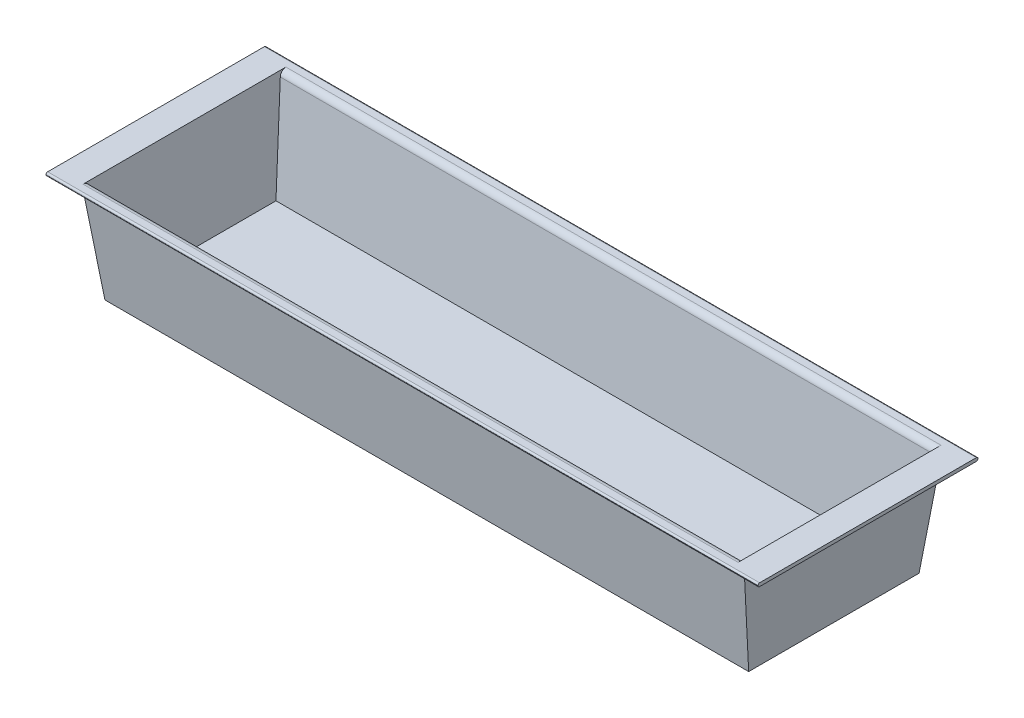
ISO-10303-21;
HEADER;
FILE_DESCRIPTION(('STEP AP214'),'2;1');
FILE_NAME('part.step','',(''),(''),'','','');
FILE_SCHEMA(('AUTOMOTIVE_DESIGN { 1 0 10303 214 1 1 1 1 }'));
ENDSEC;
DATA;
#1=APPLICATION_CONTEXT('core data for automotive mechanical design processes');
#2=APPLICATION_PROTOCOL_DEFINITION('international standard','automotive_design',2000,#1);
#3=PRODUCT_CONTEXT('',#1,'mechanical');
#4=PRODUCT('Part','Part','',(#3));
#5=PRODUCT_RELATED_PRODUCT_CATEGORY('part','',(#4));
#6=PRODUCT_DEFINITION_FORMATION('','',#4);
#7=PRODUCT_DEFINITION_CONTEXT('part definition',#1,'design');
#8=PRODUCT_DEFINITION('design','',#6,#7);
#9=PRODUCT_DEFINITION_SHAPE('','',#8);
#10=(LENGTH_UNIT() NAMED_UNIT(*) SI_UNIT(.MILLI.,.METRE.));
#11=(NAMED_UNIT(*) PLANE_ANGLE_UNIT() SI_UNIT($,.RADIAN.));
#12=(NAMED_UNIT(*) SI_UNIT($,.STERADIAN.) SOLID_ANGLE_UNIT());
#13=UNCERTAINTY_MEASURE_WITH_UNIT(LENGTH_MEASURE(1.E-05),#10,'distance_accuracy_value','');
#14=(GEOMETRIC_REPRESENTATION_CONTEXT(3) GLOBAL_UNCERTAINTY_ASSIGNED_CONTEXT((#13)) GLOBAL_UNIT_ASSIGNED_CONTEXT((#10,
#11,#12)) REPRESENTATION_CONTEXT('',''));
#15=CARTESIAN_POINT('',(0.,0.,0.));
#16=DIRECTION('',(0.,0.,1.));
#17=DIRECTION('',(1.,0.,0.));
#18=AXIS2_PLACEMENT_3D('',#15,#16,#17);
#19=CARTESIAN_POINT('',(0.,0.,0.));
#20=DIRECTION('',(0.,-1.,0.));
#21=DIRECTION('',(0.,0.,-1.));
#22=AXIS2_PLACEMENT_3D('',#19,#20,#21);
#23=PLANE('',#22);
#24=DIRECTION('',(0.,0.,1.));
#25=VECTOR('',#24,1.);
#26=CARTESIAN_POINT('',(-172.991972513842,0.,0.));
#27=LINE('',#26,#25);
#28=CARTESIAN_POINT('',(-172.991972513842,0.,-53.5762929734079));
#29=VERTEX_POINT('',#28);
#30=CARTESIAN_POINT('',(-172.991972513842,0.,53.5762929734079));
#31=VERTEX_POINT('',#30);
#32=EDGE_CURVE('E204',#29,#31,#27,.T.);
#33=ORIENTED_EDGE('',*,*,#32,.F.);
#34=DIRECTION('',(-1.,0.,0.));
#35=VECTOR('',#34,1.);
#36=CARTESIAN_POINT('',(172.991972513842,0.,-53.5762929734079));
#37=LINE('',#36,#35);
#38=CARTESIAN_POINT('',(172.991972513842,0.,-53.5762929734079));
#39=VERTEX_POINT('',#38);
#40=EDGE_CURVE('E272',#29,#39,#37,.F.);
#41=ORIENTED_EDGE('',*,*,#40,.T.);
#42=DIRECTION('',(0.,0.,-1.));
#43=VECTOR('',#42,1.);
#44=CARTESIAN_POINT('',(172.991972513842,0.,0.));
#45=LINE('',#44,#43);
#46=CARTESIAN_POINT('',(172.991972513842,0.,53.5762929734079));
#47=VERTEX_POINT('',#46);
#48=EDGE_CURVE('E201',#47,#39,#45,.T.);
#49=ORIENTED_EDGE('',*,*,#48,.F.);
#50=DIRECTION('',(1.,0.,0.));
#51=VECTOR('',#50,1.);
#52=CARTESIAN_POINT('',(-172.991972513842,0.,53.5762929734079));
#53=LINE('',#52,#51);
#54=EDGE_CURVE('E282',#47,#31,#53,.F.);
#55=ORIENTED_EDGE('',*,*,#54,.T.);
#56=EDGE_LOOP('',(#33,#41,#49,#55));
#57=FACE_BOUND('',#56,.T.);
#58=DIRECTION('',(0.,0.,1.));
#59=VECTOR('',#58,1.);
#60=CARTESIAN_POINT('',(-188.,0.,58.125));
#61=LINE('',#60,#59);
#62=CARTESIAN_POINT('',(-188.,0.,-57.25));
#63=VERTEX_POINT('',#62);
#64=CARTESIAN_POINT('',(-188.,0.,57.25));
#65=VERTEX_POINT('',#64);
#66=EDGE_CURVE('E441',#63,#65,#61,.T.);
#67=ORIENTED_EDGE('',*,*,#66,.T.);
#68=DIRECTION('',(1.,0.,0.));
#69=VECTOR('',#68,1.);
#70=CARTESIAN_POINT('',(188.,0.,57.25));
#71=LINE('',#70,#69);
#72=CARTESIAN_POINT('',(188.,0.,57.25));
#73=VERTEX_POINT('',#72);
#74=EDGE_CURVE('E308',#65,#73,#71,.T.);
#75=ORIENTED_EDGE('',*,*,#74,.T.);
#76=DIRECTION('',(0.,0.,-1.));
#77=VECTOR('',#76,1.);
#78=CARTESIAN_POINT('',(188.,0.,58.125));
#79=LINE('',#78,#77);
#80=CARTESIAN_POINT('',(188.,0.,-57.25));
#81=VERTEX_POINT('',#80);
#82=EDGE_CURVE('E315',#73,#81,#79,.T.);
#83=ORIENTED_EDGE('',*,*,#82,.T.);
#84=DIRECTION('',(-1.,0.,0.));
#85=VECTOR('',#84,1.);
#86=CARTESIAN_POINT('',(-188.,0.,-57.25));
#87=LINE('',#86,#85);
#88=EDGE_CURVE('E317',#81,#63,#87,.T.);
#89=ORIENTED_EDGE('',*,*,#88,.T.);
#90=EDGE_LOOP('',(#67,#75,#83,#89));
#91=FACE_BOUND('',#90,.T.);
#92=ADVANCED_FACE('F42',(#57,#91),#23,.F.);
#93=CARTESIAN_POINT('',(0.,-53.75,0.));
#94=DIRECTION('',(0.,1.,0.));
#95=DIRECTION('',(0.,0.,1.));
#96=AXIS2_PLACEMENT_3D('',#93,#94,#95);
#97=PLANE('',#96);
#98=DIRECTION('',(0.,0.,-1.));
#99=VECTOR('',#98,1.);
#100=CARTESIAN_POINT('',(168.171344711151,-53.75,0.));
#101=LINE('',#100,#99);
#102=CARTESIAN_POINT('',(168.171344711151,-53.75,43.5032934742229));
#103=VERTEX_POINT('',#102);
#104=CARTESIAN_POINT('',(168.171344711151,-53.75,-43.5032934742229));
#105=VERTEX_POINT('',#104);
#106=EDGE_CURVE('E172',#103,#105,#101,.T.);
#107=ORIENTED_EDGE('',*,*,#106,.T.);
#108=DIRECTION('',(-1.,0.,0.));
#109=VECTOR('',#108,1.);
#110=CARTESIAN_POINT('',(0.,-53.75,-43.5032934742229));
#111=LINE('',#110,#109);
#112=CARTESIAN_POINT('',(-168.171344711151,-53.75,-43.5032934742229));
#113=VERTEX_POINT('',#112);
#114=EDGE_CURVE('E184',#105,#113,#111,.T.);
#115=ORIENTED_EDGE('',*,*,#114,.T.);
#116=DIRECTION('',(0.,0.,1.));
#117=VECTOR('',#116,1.);
#118=CARTESIAN_POINT('',(-168.171344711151,-53.75,0.));
#119=LINE('',#118,#117);
#120=CARTESIAN_POINT('',(-168.171344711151,-53.75,43.5032934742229));
#121=VERTEX_POINT('',#120);
#122=EDGE_CURVE('E175',#113,#121,#119,.T.);
#123=ORIENTED_EDGE('',*,*,#122,.T.);
#124=DIRECTION('',(1.,0.,0.));
#125=VECTOR('',#124,1.);
#126=CARTESIAN_POINT('',(0.,-53.75,43.5032934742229));
#127=LINE('',#126,#125);
#128=EDGE_CURVE('E167',#121,#103,#127,.T.);
#129=ORIENTED_EDGE('',*,*,#128,.T.);
#130=EDGE_LOOP('',(#107,#115,#123,#129));
#131=FACE_BOUND('',#130,.T.);
#132=ADVANCED_FACE('F169',(#131),#97,.T.);
#133=CARTESIAN_POINT('',(0.,-6.703905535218,49.8323644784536));
#134=DIRECTION('',(0.,0.133328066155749,-0.991071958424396));
#135=DIRECTION('',(0.,0.991071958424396,0.133328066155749));
#136=AXIS2_PLACEMENT_3D('',#133,#134,#135);
#137=PLANE('',#136);
#138=DIRECTION('',(-0.0885363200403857,0.987179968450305,0.13280448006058));
#139=VECTOR('',#138,1.);
#140=CARTESIAN_POINT('',(-171.039409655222,-21.7710758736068,47.8053908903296));
#141=LINE('',#140,#139);
#142=CARTESIAN_POINT('',(-172.739355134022,-2.81668378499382,50.3553091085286));
#143=VERTEX_POINT('',#142);
#144=EDGE_CURVE('E183',#121,#143,#141,.T.);
#145=ORIENTED_EDGE('',*,*,#144,.T.);
#146=DIRECTION('',(1.,0.,0.));
#147=VECTOR('',#146,1.);
#148=CARTESIAN_POINT('',(172.991972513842,-2.81668378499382,50.3553091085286));
#149=LINE('',#148,#147);
#150=CARTESIAN_POINT('',(172.739355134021,-2.81668378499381,50.3553091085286));
#151=VERTEX_POINT('',#150);
#152=EDGE_CURVE('E181',#143,#151,#149,.T.);
#153=ORIENTED_EDGE('',*,*,#152,.T.);
#154=DIRECTION('',(0.0885363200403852,0.987179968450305,0.13280448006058));
#155=VECTOR('',#154,1.);
#156=CARTESIAN_POINT('',(171.039409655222,-21.7710758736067,47.8053908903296));
#157=LINE('',#156,#155);
#158=EDGE_CURVE('E179',#103,#151,#157,.T.);
#159=ORIENTED_EDGE('',*,*,#158,.F.);
#160=ORIENTED_EDGE('',*,*,#128,.F.);
#161=EDGE_LOOP('',(#145,#153,#159,#160));
#162=FACE_BOUND('',#161,.T.);
#163=ADVANCED_FACE('F180',(#162),#137,.T.);
#164=CARTESIAN_POINT('',(-171.611598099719,-15.3911747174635,0.));
#165=DIRECTION('',(0.99600230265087,0.0893275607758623,0.));
#166=DIRECTION('',(-0.0893275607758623,0.99600230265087,0.));
#167=AXIS2_PLACEMENT_3D('',#164,#165,#166);
#168=PLANE('',#167);
#169=ORIENTED_EDGE('',*,*,#144,.F.);
#170=ORIENTED_EDGE('',*,*,#122,.F.);
#171=DIRECTION('',(-0.0885363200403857,0.987179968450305,-0.132804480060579));
#172=VECTOR('',#171,1.);
#173=CARTESIAN_POINT('',(-171.039409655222,-21.7710758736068,-47.8053908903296));
#174=LINE('',#173,#172);
#175=CARTESIAN_POINT('',(-172.739355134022,-2.81668378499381,-50.3553091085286));
#176=VERTEX_POINT('',#175);
#177=EDGE_CURVE('E198',#113,#176,#174,.T.);
#178=ORIENTED_EDGE('',*,*,#177,.T.);
#179=CARTESIAN_POINT('',(-172.700492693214,-3.25,-53.5762929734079));
#180=DIRECTION('',(0.99600230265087,0.0893275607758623,0.));
#181=DIRECTION('',(0.0893275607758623,-0.99600230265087,0.));
#182=AXIS2_PLACEMENT_3D('',#179,#180,#181);
#183=ELLIPSE('',#182,3.26304466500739,3.25);
#184=EDGE_CURVE('E275',#176,#29,#183,.F.);
#185=ORIENTED_EDGE('',*,*,#184,.T.);
#186=ORIENTED_EDGE('',*,*,#32,.T.);
#187=CARTESIAN_POINT('',(-172.700492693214,-3.25,53.5762929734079));
#188=DIRECTION('',(0.99600230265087,0.0893275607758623,0.));
#189=DIRECTION('',(-0.0893275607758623,0.99600230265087,0.));
#190=AXIS2_PLACEMENT_3D('',#187,#188,#189);
#191=ELLIPSE('',#190,3.26304466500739,3.25);
#192=EDGE_CURVE('E12',#31,#143,#191,.F.);
#193=ORIENTED_EDGE('',*,*,#192,.T.);
#194=EDGE_LOOP('',(#169,#170,#178,#185,#186,#193));
#195=FACE_BOUND('',#194,.T.);
#196=ADVANCED_FACE('F480',(#195),#168,.T.);
#197=CARTESIAN_POINT('',(171.611598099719,-15.3911747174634,0.));
#198=DIRECTION('',(-0.99600230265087,0.0893275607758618,0.));
#199=DIRECTION('',(-0.0893275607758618,-0.99600230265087,0.));
#200=AXIS2_PLACEMENT_3D('',#197,#198,#199);
#201=PLANE('',#200);
#202=DIRECTION('',(0.0885363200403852,0.987179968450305,-0.132804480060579));
#203=VECTOR('',#202,1.);
#204=CARTESIAN_POINT('',(171.039409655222,-21.7710758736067,-47.8053908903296));
#205=LINE('',#204,#203);
#206=CARTESIAN_POINT('',(172.739355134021,-2.81668378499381,-50.3553091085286));
#207=VERTEX_POINT('',#206);
#208=EDGE_CURVE('E188',#105,#207,#205,.T.);
#209=ORIENTED_EDGE('',*,*,#208,.F.);
#210=ORIENTED_EDGE('',*,*,#106,.F.);
#211=ORIENTED_EDGE('',*,*,#158,.T.);
#212=CARTESIAN_POINT('',(172.700492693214,-3.25,53.5762929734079));
#213=DIRECTION('',(-0.99600230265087,0.0893275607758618,0.));
#214=DIRECTION('',(-0.0893275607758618,-0.99600230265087,0.));
#215=AXIS2_PLACEMENT_3D('',#212,#213,#214);
#216=ELLIPSE('',#215,3.26304466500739,3.25);
#217=EDGE_CURVE('E50',#151,#47,#216,.F.);
#218=ORIENTED_EDGE('',*,*,#217,.T.);
#219=ORIENTED_EDGE('',*,*,#48,.T.);
#220=CARTESIAN_POINT('',(172.700492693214,-3.25,-53.5762929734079));
#221=DIRECTION('',(-0.99600230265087,0.0893275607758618,0.));
#222=DIRECTION('',(0.0893275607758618,0.99600230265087,0.));
#223=AXIS2_PLACEMENT_3D('',#220,#221,#222);
#224=ELLIPSE('',#223,3.26304466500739,3.25);
#225=EDGE_CURVE('E270',#39,#207,#224,.F.);
#226=ORIENTED_EDGE('',*,*,#225,.T.);
#227=EDGE_LOOP('',(#209,#210,#211,#218,#219,#226));
#228=FACE_BOUND('',#227,.T.);
#229=ADVANCED_FACE('F186',(#228),#201,.T.);
#230=CARTESIAN_POINT('',(0.,-6.70390553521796,-49.8323644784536));
#231=DIRECTION('',(0.,0.133328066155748,0.991071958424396));
#232=DIRECTION('',(0.,-0.991071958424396,0.133328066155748));
#233=AXIS2_PLACEMENT_3D('',#230,#231,#232);
#234=PLANE('',#233);
#235=ORIENTED_EDGE('',*,*,#208,.T.);
#236=DIRECTION('',(-1.,0.,0.));
#237=VECTOR('',#236,1.);
#238=CARTESIAN_POINT('',(-172.991972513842,-2.81668378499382,-50.3553091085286));
#239=LINE('',#238,#237);
#240=EDGE_CURVE('E274',#207,#176,#239,.T.);
#241=ORIENTED_EDGE('',*,*,#240,.T.);
#242=ORIENTED_EDGE('',*,*,#177,.F.);
#243=ORIENTED_EDGE('',*,*,#114,.F.);
#244=EDGE_LOOP('',(#235,#241,#242,#243));
#245=FACE_BOUND('',#244,.T.);
#246=ADVANCED_FACE('F359',(#245),#234,.T.);
#247=CARTESIAN_POINT('',(0.,-1.75,0.));
#248=DIRECTION('',(0.,-1.,0.));
#249=DIRECTION('',(0.,0.,-1.));
#250=AXIS2_PLACEMENT_3D('',#247,#248,#249);
#251=PLANE('',#250);
#252=DIRECTION('',(0.,0.,-1.));
#253=VECTOR('',#252,1.);
#254=CARTESIAN_POINT('',(188.,-1.75,58.125));
#255=LINE('',#254,#253);
#256=CARTESIAN_POINT('',(188.,-1.75,57.25));
#257=VERTEX_POINT('',#256);
#258=CARTESIAN_POINT('',(188.,-1.75,-57.25));
#259=VERTEX_POINT('',#258);
#260=EDGE_CURVE('E438',#257,#259,#255,.T.);
#261=ORIENTED_EDGE('',*,*,#260,.F.);
#262=DIRECTION('',(1.,0.,0.));
#263=VECTOR('',#262,1.);
#264=CARTESIAN_POINT('',(0.,-1.75,57.25));
#265=LINE('',#264,#263);
#266=CARTESIAN_POINT('',(-188.,-1.75,57.25));
#267=VERTEX_POINT('',#266);
#268=EDGE_CURVE('E327',#257,#267,#265,.F.);
#269=ORIENTED_EDGE('',*,*,#268,.T.);
#270=DIRECTION('',(0.,0.,1.));
#271=VECTOR('',#270,1.);
#272=CARTESIAN_POINT('',(-188.,-1.75,58.125));
#273=LINE('',#272,#271);
#274=CARTESIAN_POINT('',(-188.,-1.75,-57.25));
#275=VERTEX_POINT('',#274);
#276=EDGE_CURVE('E436',#275,#267,#273,.T.);
#277=ORIENTED_EDGE('',*,*,#276,.F.);
#278=DIRECTION('',(-1.,0.,0.));
#279=VECTOR('',#278,1.);
#280=CARTESIAN_POINT('',(0.,-1.75,-57.25));
#281=LINE('',#280,#279);
#282=EDGE_CURVE('E330',#275,#259,#281,.F.);
#283=ORIENTED_EDGE('',*,*,#282,.T.);
#284=EDGE_LOOP('',(#261,#269,#277,#283));
#285=FACE_BOUND('',#284,.T.);
#286=DIRECTION('',(0.,0.,1.));
#287=VECTOR('',#286,1.);
#288=CARTESIAN_POINT('',(174.843049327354,-1.75,0.));
#289=LINE('',#288,#287);
#290=CARTESIAN_POINT('',(174.843049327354,-1.75,-53.5762929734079));
#291=VERTEX_POINT('',#290);
#292=CARTESIAN_POINT('',(174.843049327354,-1.75,53.5762929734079));
#293=VERTEX_POINT('',#292);
#294=EDGE_CURVE('E191',#291,#293,#289,.T.);
#295=ORIENTED_EDGE('',*,*,#294,.F.);
#296=DIRECTION('',(1.,0.,0.));
#297=VECTOR('',#296,1.);
#298=CARTESIAN_POINT('',(0.,-1.75,-53.5762929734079));
#299=LINE('',#298,#297);
#300=CARTESIAN_POINT('',(-174.843049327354,-1.75,-53.5762929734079));
#301=VERTEX_POINT('',#300);
#302=EDGE_CURVE('E299',#291,#301,#299,.F.);
#303=ORIENTED_EDGE('',*,*,#302,.T.);
#304=DIRECTION('',(0.,0.,-1.));
#305=VECTOR('',#304,1.);
#306=CARTESIAN_POINT('',(-174.843049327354,-1.75,0.));
#307=LINE('',#306,#305);
#308=CARTESIAN_POINT('',(-174.843049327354,-1.75,53.5762929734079));
#309=VERTEX_POINT('',#308);
#310=EDGE_CURVE('E189',#309,#301,#307,.T.);
#311=ORIENTED_EDGE('',*,*,#310,.F.);
#312=DIRECTION('',(-1.,0.,0.));
#313=VECTOR('',#312,1.);
#314=CARTESIAN_POINT('',(0.,-1.75,53.5762929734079));
#315=LINE('',#314,#313);
#316=EDGE_CURVE('E302',#309,#293,#315,.F.);
#317=ORIENTED_EDGE('',*,*,#316,.T.);
#318=EDGE_LOOP('',(#295,#303,#311,#317));
#319=FACE_BOUND('',#318,.T.);
#320=ADVANCED_FACE('F435',(#285,#319),#251,.T.);
#321=CARTESIAN_POINT('',(188.,-1.75,58.125));
#322=DIRECTION('',(1.,0.,0.));
#323=DIRECTION('',(0.,0.,-1.));
#324=AXIS2_PLACEMENT_3D('',#321,#322,#323);
#325=PLANE('',#324);
#326=CARTESIAN_POINT('',(188.,-0.875,57.25));
#327=DIRECTION('',(1.,0.,0.));
#328=DIRECTION('',(0.,0.,-1.));
#329=AXIS2_PLACEMENT_3D('',#326,#327,#328);
#330=CIRCLE('',#329,0.875);
#331=CARTESIAN_POINT('',(188.,-0.875,58.125));
#332=VERTEX_POINT('',#331);
#333=EDGE_CURVE('E335',#73,#332,#330,.T.);
#334=ORIENTED_EDGE('',*,*,#333,.T.);
#335=CARTESIAN_POINT('',(188.,-0.875,57.25));
#336=DIRECTION('',(1.,0.,0.));
#337=DIRECTION('',(0.,0.,-1.));
#338=AXIS2_PLACEMENT_3D('',#335,#336,#337);
#339=CIRCLE('',#338,0.875);
#340=EDGE_CURVE('E333',#332,#257,#339,.T.);
#341=ORIENTED_EDGE('',*,*,#340,.T.);
#342=ORIENTED_EDGE('',*,*,#260,.T.);
#343=CARTESIAN_POINT('',(188.,-0.875,-57.25));
#344=DIRECTION('',(1.,0.,0.));
#345=DIRECTION('',(0.,0.,-1.));
#346=AXIS2_PLACEMENT_3D('',#343,#344,#345);
#347=CIRCLE('',#346,0.875);
#348=CARTESIAN_POINT('',(188.,-0.875,-58.125));
#349=VERTEX_POINT('',#348);
#350=EDGE_CURVE('E337',#259,#349,#347,.T.);
#351=ORIENTED_EDGE('',*,*,#350,.T.);
#352=CARTESIAN_POINT('',(188.,-0.875,-57.25));
#353=DIRECTION('',(1.,0.,0.));
#354=DIRECTION('',(0.,0.,-1.));
#355=AXIS2_PLACEMENT_3D('',#352,#353,#354);
#356=CIRCLE('',#355,0.875);
#357=EDGE_CURVE('E339',#349,#81,#356,.T.);
#358=ORIENTED_EDGE('',*,*,#357,.T.);
#359=ORIENTED_EDGE('',*,*,#82,.F.);
#360=EDGE_LOOP('',(#334,#341,#342,#351,#358,#359));
#361=FACE_BOUND('',#360,.T.);
#362=ADVANCED_FACE('F449',(#361),#325,.T.);
#363=CARTESIAN_POINT('',(-188.,-1.75,58.125));
#364=DIRECTION('',(-1.,0.,0.));
#365=DIRECTION('',(0.,0.,1.));
#366=AXIS2_PLACEMENT_3D('',#363,#364,#365);
#367=PLANE('',#366);
#368=ORIENTED_EDGE('',*,*,#276,.T.);
#369=CARTESIAN_POINT('',(-188.,-0.875,57.25));
#370=DIRECTION('',(-1.,0.,0.));
#371=DIRECTION('',(0.,0.,1.));
#372=AXIS2_PLACEMENT_3D('',#369,#370,#371);
#373=CIRCLE('',#372,0.875);
#374=CARTESIAN_POINT('',(-188.,-0.875,58.125));
#375=VERTEX_POINT('',#374);
#376=EDGE_CURVE('E319',#267,#375,#373,.T.);
#377=ORIENTED_EDGE('',*,*,#376,.T.);
#378=CARTESIAN_POINT('',(-188.,-0.875,57.25));
#379=DIRECTION('',(-1.,0.,0.));
#380=DIRECTION('',(0.,0.,1.));
#381=AXIS2_PLACEMENT_3D('',#378,#379,#380);
#382=CIRCLE('',#381,0.875);
#383=EDGE_CURVE('E321',#375,#65,#382,.T.);
#384=ORIENTED_EDGE('',*,*,#383,.T.);
#385=ORIENTED_EDGE('',*,*,#66,.F.);
#386=CARTESIAN_POINT('',(-188.,-0.875,-57.25));
#387=DIRECTION('',(-1.,0.,0.));
#388=DIRECTION('',(0.,0.,1.));
#389=AXIS2_PLACEMENT_3D('',#386,#387,#388);
#390=CIRCLE('',#389,0.875);
#391=CARTESIAN_POINT('',(-188.,-0.875,-58.125));
#392=VERTEX_POINT('',#391);
#393=EDGE_CURVE('E325',#63,#392,#390,.T.);
#394=ORIENTED_EDGE('',*,*,#393,.T.);
#395=CARTESIAN_POINT('',(-188.,-0.875,-57.25));
#396=DIRECTION('',(-1.,0.,0.));
#397=DIRECTION('',(0.,0.,1.));
#398=AXIS2_PLACEMENT_3D('',#395,#396,#397);
#399=CIRCLE('',#398,0.875);
#400=EDGE_CURVE('E323',#392,#275,#399,.T.);
#401=ORIENTED_EDGE('',*,*,#400,.T.);
#402=EDGE_LOOP('',(#368,#377,#384,#385,#394,#401));
#403=FACE_BOUND('',#402,.T.);
#404=ADVANCED_FACE('F357',(#403),#367,.T.);
#405=CARTESIAN_POINT('',(0.,-55.75,0.));
#406=DIRECTION('',(0.,1.,0.));
#407=DIRECTION('',(0.,0.,1.));
#408=AXIS2_PLACEMENT_3D('',#405,#406,#407);
#409=PLANE('',#408);
#410=DIRECTION('',(0.,0.,-1.));
#411=VECTOR('',#410,1.);
#412=CARTESIAN_POINT('',(170.,-55.75,-45.));
#413=LINE('',#412,#411);
#414=CARTESIAN_POINT('',(170.,-55.75,45.));
#415=VERTEX_POINT('',#414);
#416=CARTESIAN_POINT('',(170.,-55.75,-45.));
#417=VERTEX_POINT('',#416);
#418=EDGE_CURVE('E206',#415,#417,#413,.T.);
#419=ORIENTED_EDGE('',*,*,#418,.F.);
#420=DIRECTION('',(1.,0.,0.));
#421=VECTOR('',#420,1.);
#422=CARTESIAN_POINT('',(-170.,-55.75,45.));
#423=LINE('',#422,#421);
#424=CARTESIAN_POINT('',(-170.,-55.75,45.));
#425=VERTEX_POINT('',#424);
#426=EDGE_CURVE('E381',#425,#415,#423,.T.);
#427=ORIENTED_EDGE('',*,*,#426,.F.);
#428=DIRECTION('',(0.,0.,1.));
#429=VECTOR('',#428,1.);
#430=CARTESIAN_POINT('',(-170.,-55.75,-45.));
#431=LINE('',#430,#429);
#432=CARTESIAN_POINT('',(-170.,-55.75,-45.));
#433=VERTEX_POINT('',#432);
#434=EDGE_CURVE('E387',#433,#425,#431,.T.);
#435=ORIENTED_EDGE('',*,*,#434,.F.);
#436=DIRECTION('',(-1.,0.,0.));
#437=VECTOR('',#436,1.);
#438=CARTESIAN_POINT('',(-170.,-55.75,-45.));
#439=LINE('',#438,#437);
#440=EDGE_CURVE('E212',#417,#433,#439,.T.);
#441=ORIENTED_EDGE('',*,*,#440,.F.);
#442=EDGE_LOOP('',(#419,#427,#435,#441));
#443=FACE_BOUND('',#442,.T.);
#444=ADVANCED_FACE('F231',(#443),#409,.F.);
#445=CARTESIAN_POINT('',(0.,-6.93722965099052,-51.5667404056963));
#446=DIRECTION('',(0.,0.133328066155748,0.991071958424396));
#447=DIRECTION('',(0.,-0.991071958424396,0.133328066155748));
#448=AXIS2_PLACEMENT_3D('',#445,#446,#447);
#449=PLANE('',#448);
#450=DIRECTION('',(-0.0885363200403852,0.987179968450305,-0.132804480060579));
#451=VECTOR('',#450,1.);
#452=CARTESIAN_POINT('',(-170.,-55.75,-45.));
#453=LINE('',#452,#451);
#454=CARTESIAN_POINT('',(-174.726456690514,-3.05000790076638,-52.0896850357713));
#455=VERTEX_POINT('',#454);
#456=EDGE_CURVE('E341',#433,#455,#453,.T.);
#457=ORIENTED_EDGE('',*,*,#456,.T.);
#458=DIRECTION('',(1.,0.,0.));
#459=VECTOR('',#458,1.);
#460=CARTESIAN_POINT('',(0.,-3.05000790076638,-52.0896850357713));
#461=LINE('',#460,#459);
#462=CARTESIAN_POINT('',(174.726456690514,-3.05000790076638,-52.0896850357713));
#463=VERTEX_POINT('',#462);
#464=EDGE_CURVE('E305',#455,#463,#461,.T.);
#465=ORIENTED_EDGE('',*,*,#464,.T.);
#466=DIRECTION('',(0.0885363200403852,0.987179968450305,-0.132804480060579));
#467=VECTOR('',#466,1.);
#468=CARTESIAN_POINT('',(170.,-55.75,-45.));
#469=LINE('',#468,#467);
#470=EDGE_CURVE('E218',#417,#463,#469,.T.);
#471=ORIENTED_EDGE('',*,*,#470,.F.);
#472=ORIENTED_EDGE('',*,*,#440,.T.);
#473=EDGE_LOOP('',(#457,#465,#471,#472));
#474=FACE_BOUND('',#473,.T.);
#475=ADVANCED_FACE('F220',(#474),#449,.F.);
#476=CARTESIAN_POINT('',(173.603602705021,-15.5698298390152,0.));
#477=DIRECTION('',(-0.99600230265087,0.0893275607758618,0.));
#478=DIRECTION('',(-0.0893275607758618,-0.99600230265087,0.));
#479=AXIS2_PLACEMENT_3D('',#476,#477,#478);
#480=PLANE('',#479);
#481=ORIENTED_EDGE('',*,*,#470,.T.);
#482=CARTESIAN_POINT('',(174.708520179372,-3.25,-53.5762929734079));
#483=DIRECTION('',(-0.99600230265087,0.0893275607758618,0.));
#484=DIRECTION('',(0.0893275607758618,0.99600230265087,0.));
#485=AXIS2_PLACEMENT_3D('',#482,#483,#484);
#486=ELLIPSE('',#485,1.5060206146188,1.5);
#487=EDGE_CURVE('E293',#463,#291,#486,.T.);
#488=ORIENTED_EDGE('',*,*,#487,.T.);
#489=ORIENTED_EDGE('',*,*,#294,.T.);
#490=CARTESIAN_POINT('',(174.708520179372,-3.25,53.5762929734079));
#491=DIRECTION('',(-0.99600230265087,0.0893275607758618,0.));
#492=DIRECTION('',(-0.0893275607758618,-0.99600230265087,0.));
#493=AXIS2_PLACEMENT_3D('',#490,#491,#492);
#494=ELLIPSE('',#493,1.5060206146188,1.5);
#495=CARTESIAN_POINT('',(174.726456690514,-3.05000790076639,52.0896850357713));
#496=VERTEX_POINT('',#495);
#497=EDGE_CURVE('E286',#293,#496,#494,.T.);
#498=ORIENTED_EDGE('',*,*,#497,.T.);
#499=DIRECTION('',(0.0885363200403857,0.987179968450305,0.13280448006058));
#500=VECTOR('',#499,1.);
#501=CARTESIAN_POINT('',(170.,-55.75,45.));
#502=LINE('',#501,#500);
#503=EDGE_CURVE('E395',#415,#496,#502,.T.);
#504=ORIENTED_EDGE('',*,*,#503,.F.);
#505=ORIENTED_EDGE('',*,*,#418,.T.);
#506=EDGE_LOOP('',(#481,#488,#489,#498,#504,#505));
#507=FACE_BOUND('',#506,.T.);
#508=ADVANCED_FACE('F230',(#507),#480,.F.);
#509=CARTESIAN_POINT('',(-173.603602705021,-15.5698298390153,0.));
#510=DIRECTION('',(0.99600230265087,0.0893275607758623,0.));
#511=DIRECTION('',(-0.0893275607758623,0.99600230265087,0.));
#512=AXIS2_PLACEMENT_3D('',#509,#510,#511);
#513=PLANE('',#512);
#514=DIRECTION('',(-0.0885363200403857,0.987179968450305,0.13280448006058));
#515=VECTOR('',#514,1.);
#516=CARTESIAN_POINT('',(-170.,-55.75,45.));
#517=LINE('',#516,#515);
#518=CARTESIAN_POINT('',(-174.726456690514,-3.05000790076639,52.0896850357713));
#519=VERTEX_POINT('',#518);
#520=EDGE_CURVE('E404',#425,#519,#517,.T.);
#521=ORIENTED_EDGE('',*,*,#520,.T.);
#522=CARTESIAN_POINT('',(-174.708520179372,-3.25,53.5762929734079));
#523=DIRECTION('',(0.99600230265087,0.0893275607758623,0.));
#524=DIRECTION('',(-0.0893275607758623,0.99600230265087,0.));
#525=AXIS2_PLACEMENT_3D('',#522,#523,#524);
#526=ELLIPSE('',#525,1.5060206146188,1.5);
#527=EDGE_CURVE('E288',#519,#309,#526,.T.);
#528=ORIENTED_EDGE('',*,*,#527,.T.);
#529=ORIENTED_EDGE('',*,*,#310,.T.);
#530=CARTESIAN_POINT('',(-174.708520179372,-3.25,-53.5762929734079));
#531=DIRECTION('',(0.99600230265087,0.0893275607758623,0.));
#532=DIRECTION('',(0.0893275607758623,-0.99600230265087,0.));
#533=AXIS2_PLACEMENT_3D('',#530,#531,#532);
#534=ELLIPSE('',#533,1.5060206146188,1.5);
#535=EDGE_CURVE('E291',#301,#455,#534,.T.);
#536=ORIENTED_EDGE('',*,*,#535,.T.);
#537=ORIENTED_EDGE('',*,*,#456,.F.);
#538=ORIENTED_EDGE('',*,*,#434,.T.);
#539=EDGE_LOOP('',(#521,#528,#529,#536,#537,#538));
#540=FACE_BOUND('',#539,.T.);
#541=ADVANCED_FACE('F431',(#540),#513,.F.);
#542=CARTESIAN_POINT('',(0.,-6.93722965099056,51.5667404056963));
#543=DIRECTION('',(0.,0.133328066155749,-0.991071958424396));
#544=DIRECTION('',(0.,0.991071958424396,0.133328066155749));
#545=AXIS2_PLACEMENT_3D('',#542,#543,#544);
#546=PLANE('',#545);
#547=ORIENTED_EDGE('',*,*,#503,.T.);
#548=DIRECTION('',(-1.,0.,0.));
#549=VECTOR('',#548,1.);
#550=CARTESIAN_POINT('',(0.,-3.05000790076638,52.0896850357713));
#551=LINE('',#550,#549);
#552=EDGE_CURVE('E296',#496,#519,#551,.T.);
#553=ORIENTED_EDGE('',*,*,#552,.T.);
#554=ORIENTED_EDGE('',*,*,#520,.F.);
#555=ORIENTED_EDGE('',*,*,#426,.T.);
#556=EDGE_LOOP('',(#547,#553,#554,#555));
#557=FACE_BOUND('',#556,.T.);
#558=ADVANCED_FACE('F245',(#557),#546,.F.);
#559=CARTESIAN_POINT('',(0.,-0.875,57.25));
#560=DIRECTION('',(-1.,0.,0.));
#561=DIRECTION('',(0.,0.,1.));
#562=AXIS2_PLACEMENT_3D('',#559,#560,#561);
#563=CYLINDRICAL_SURFACE('',#562,0.875);
#564=ORIENTED_EDGE('',*,*,#74,.F.);
#565=ORIENTED_EDGE('',*,*,#383,.F.);
#566=DIRECTION('',(1.,0.,0.));
#567=VECTOR('',#566,1.);
#568=CARTESIAN_POINT('',(-188.,-0.875,58.125));
#569=LINE('',#568,#567);
#570=EDGE_CURVE('E312',#332,#375,#569,.F.);
#571=ORIENTED_EDGE('',*,*,#570,.F.);
#572=ORIENTED_EDGE('',*,*,#333,.F.);
#573=EDGE_LOOP('',(#564,#565,#571,#572));
#574=FACE_BOUND('',#573,.T.);
#575=ADVANCED_FACE('F241',(#574),#563,.T.);
#576=CARTESIAN_POINT('',(-188.,-0.875,57.25));
#577=DIRECTION('',(1.,0.,0.));
#578=DIRECTION('',(0.,0.,-1.));
#579=AXIS2_PLACEMENT_3D('',#576,#577,#578);
#580=CYLINDRICAL_SURFACE('',#579,0.875);
#581=ORIENTED_EDGE('',*,*,#376,.F.);
#582=ORIENTED_EDGE('',*,*,#268,.F.);
#583=ORIENTED_EDGE('',*,*,#340,.F.);
#584=ORIENTED_EDGE('',*,*,#570,.T.);
#585=EDGE_LOOP('',(#581,#582,#583,#584));
#586=FACE_BOUND('',#585,.T.);
#587=ADVANCED_FACE('F237',(#586),#580,.T.);
#588=CARTESIAN_POINT('',(0.,-0.875,-57.25));
#589=DIRECTION('',(1.,0.,0.));
#590=DIRECTION('',(0.,0.,-1.));
#591=AXIS2_PLACEMENT_3D('',#588,#589,#590);
#592=CYLINDRICAL_SURFACE('',#591,0.875);
#593=ORIENTED_EDGE('',*,*,#88,.F.);
#594=ORIENTED_EDGE('',*,*,#357,.F.);
#595=DIRECTION('',(-1.,0.,0.));
#596=VECTOR('',#595,1.);
#597=CARTESIAN_POINT('',(188.,-0.875,-58.125));
#598=LINE('',#597,#596);
#599=EDGE_CURVE('E309',#392,#349,#598,.F.);
#600=ORIENTED_EDGE('',*,*,#599,.F.);
#601=ORIENTED_EDGE('',*,*,#393,.F.);
#602=EDGE_LOOP('',(#593,#594,#600,#601));
#603=FACE_BOUND('',#602,.T.);
#604=ADVANCED_FACE('F240',(#603),#592,.T.);
#605=CARTESIAN_POINT('',(-188.,-0.875,-57.25));
#606=DIRECTION('',(-1.,0.,0.));
#607=DIRECTION('',(0.,0.,1.));
#608=AXIS2_PLACEMENT_3D('',#605,#606,#607);
#609=CYLINDRICAL_SURFACE('',#608,0.875);
#610=ORIENTED_EDGE('',*,*,#350,.F.);
#611=ORIENTED_EDGE('',*,*,#282,.F.);
#612=ORIENTED_EDGE('',*,*,#400,.F.);
#613=ORIENTED_EDGE('',*,*,#599,.T.);
#614=EDGE_LOOP('',(#610,#611,#612,#613));
#615=FACE_BOUND('',#614,.T.);
#616=ADVANCED_FACE('F247',(#615),#609,.T.);
#617=CARTESIAN_POINT('',(0.,-3.25,-53.5762929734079));
#618=DIRECTION('',(1.,0.,0.));
#619=DIRECTION('',(0.,0.,-1.));
#620=AXIS2_PLACEMENT_3D('',#617,#618,#619);
#621=CYLINDRICAL_SURFACE('',#620,1.5);
#622=ORIENTED_EDGE('',*,*,#535,.F.);
#623=ORIENTED_EDGE('',*,*,#302,.F.);
#624=ORIENTED_EDGE('',*,*,#487,.F.);
#625=ORIENTED_EDGE('',*,*,#464,.F.);
#626=EDGE_LOOP('',(#622,#623,#624,#625));
#627=FACE_BOUND('',#626,.T.);
#628=ADVANCED_FACE('F250',(#627),#621,.F.);
#629=CARTESIAN_POINT('',(0.,-3.25,53.5762929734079));
#630=DIRECTION('',(-1.,0.,0.));
#631=DIRECTION('',(0.,0.,1.));
#632=AXIS2_PLACEMENT_3D('',#629,#630,#631);
#633=CYLINDRICAL_SURFACE('',#632,1.5);
#634=ORIENTED_EDGE('',*,*,#497,.F.);
#635=ORIENTED_EDGE('',*,*,#316,.F.);
#636=ORIENTED_EDGE('',*,*,#527,.F.);
#637=ORIENTED_EDGE('',*,*,#552,.F.);
#638=EDGE_LOOP('',(#634,#635,#636,#637));
#639=FACE_BOUND('',#638,.T.);
#640=ADVANCED_FACE('F257',(#639),#633,.F.);
#641=CARTESIAN_POINT('',(0.,-3.25,-53.5762929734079));
#642=DIRECTION('',(1.,0.,0.));
#643=DIRECTION('',(0.,0.,-1.));
#644=AXIS2_PLACEMENT_3D('',#641,#642,#643);
#645=CYLINDRICAL_SURFACE('',#644,3.25);
#646=ORIENTED_EDGE('',*,*,#225,.F.);
#647=ORIENTED_EDGE('',*,*,#40,.F.);
#648=ORIENTED_EDGE('',*,*,#184,.F.);
#649=ORIENTED_EDGE('',*,*,#240,.F.);
#650=EDGE_LOOP('',(#646,#647,#648,#649));
#651=FACE_BOUND('',#650,.T.);
#652=ADVANCED_FACE('F260',(#651),#645,.T.);
#653=CARTESIAN_POINT('',(0.,-3.25,53.5762929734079));
#654=DIRECTION('',(-1.,0.,0.));
#655=DIRECTION('',(0.,0.,1.));
#656=AXIS2_PLACEMENT_3D('',#653,#654,#655);
#657=CYLINDRICAL_SURFACE('',#656,3.25);
#658=ORIENTED_EDGE('',*,*,#192,.F.);
#659=ORIENTED_EDGE('',*,*,#54,.F.);
#660=ORIENTED_EDGE('',*,*,#217,.F.);
#661=ORIENTED_EDGE('',*,*,#152,.F.);
#662=EDGE_LOOP('',(#658,#659,#660,#661));
#663=FACE_BOUND('',#662,.T.);
#664=ADVANCED_FACE('F44',(#663),#657,.T.);
#665=CLOSED_SHELL('',(#92,#132,#163,#196,#229,#246,#320,#362,#404,#444,#475,#508,#541,#558,#575,
#587,#604,#616,#628,#640,#652,#664));
#666=MANIFOLD_SOLID_BREP('B2',#665);
#667=ADVANCED_BREP_SHAPE_REPRESENTATION('',(#18,#666),#14);
#668=SHAPE_DEFINITION_REPRESENTATION(#9,#667);
ENDSEC;
END-ISO-10303-21;
